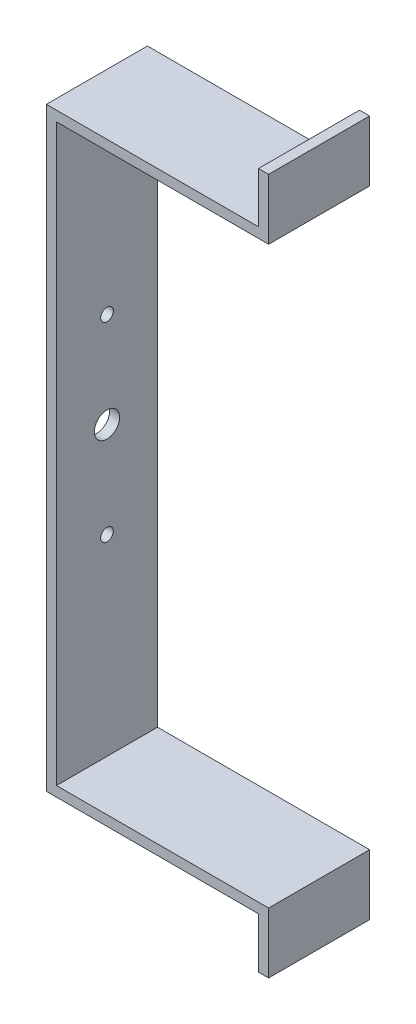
ISO-10303-21;
HEADER;
FILE_DESCRIPTION(('STEP AP214'),'2;1');
FILE_NAME('part.step','',(''),(''),'','','');
FILE_SCHEMA(('AUTOMOTIVE_DESIGN { 1 0 10303 214 1 1 1 1 }'));
ENDSEC;
DATA;
#1=APPLICATION_CONTEXT('core data for automotive mechanical design processes');
#2=APPLICATION_PROTOCOL_DEFINITION('international standard','automotive_design',2000,#1);
#3=PRODUCT_CONTEXT('',#1,'mechanical');
#4=PRODUCT('Part','Part','',(#3));
#5=PRODUCT_RELATED_PRODUCT_CATEGORY('part','',(#4));
#6=PRODUCT_DEFINITION_FORMATION('','',#4);
#7=PRODUCT_DEFINITION_CONTEXT('part definition',#1,'design');
#8=PRODUCT_DEFINITION('design','',#6,#7);
#9=PRODUCT_DEFINITION_SHAPE('','',#8);
#10=(LENGTH_UNIT() NAMED_UNIT(*) SI_UNIT(.MILLI.,.METRE.));
#11=(NAMED_UNIT(*) PLANE_ANGLE_UNIT() SI_UNIT($,.RADIAN.));
#12=(NAMED_UNIT(*) SI_UNIT($,.STERADIAN.) SOLID_ANGLE_UNIT());
#13=UNCERTAINTY_MEASURE_WITH_UNIT(LENGTH_MEASURE(1.E-05),#10,'distance_accuracy_value','');
#14=(GEOMETRIC_REPRESENTATION_CONTEXT(3) GLOBAL_UNCERTAINTY_ASSIGNED_CONTEXT((#13)) GLOBAL_UNIT_ASSIGNED_CONTEXT((#10,
#11,#12)) REPRESENTATION_CONTEXT('',''));
#15=CARTESIAN_POINT('',(0.,0.,0.));
#16=DIRECTION('',(0.,0.,1.));
#17=DIRECTION('',(1.,0.,0.));
#18=AXIS2_PLACEMENT_3D('',#15,#16,#17);
#19=CARTESIAN_POINT('',(53.34,-74.803,12.7));
#20=DIRECTION('',(1.,0.,0.));
#21=DIRECTION('',(0.,1.,0.));
#22=AXIS2_PLACEMENT_3D('',#19,#20,#21);
#23=PLANE('',#22);
#24=DIRECTION('',(0.,-1.,0.));
#25=VECTOR('',#24,1.);
#26=CARTESIAN_POINT('',(53.34,-74.803,-12.7));
#27=LINE('',#26,#25);
#28=CARTESIAN_POINT('',(53.34,-74.803,-12.7));
#29=VERTEX_POINT('',#28);
#30=CARTESIAN_POINT('',(53.34,-87.503,-12.7));
#31=VERTEX_POINT('',#30);
#32=EDGE_CURVE('E126',#29,#31,#27,.T.);
#33=ORIENTED_EDGE('',*,*,#32,.T.);
#34=DIRECTION('',(0.,0.,-1.));
#35=VECTOR('',#34,1.);
#36=CARTESIAN_POINT('',(53.34,-87.503,12.7));
#37=LINE('',#36,#35);
#38=CARTESIAN_POINT('',(53.34,-87.503,12.7));
#39=VERTEX_POINT('',#38);
#40=EDGE_CURVE('E11',#39,#31,#37,.T.);
#41=ORIENTED_EDGE('',*,*,#40,.F.);
#42=DIRECTION('',(0.,-1.,0.));
#43=VECTOR('',#42,1.);
#44=CARTESIAN_POINT('',(53.34,-74.803,12.7));
#45=LINE('',#44,#43);
#46=CARTESIAN_POINT('',(53.34,-74.803,12.7));
#47=VERTEX_POINT('',#46);
#48=EDGE_CURVE('E162',#47,#39,#45,.T.);
#49=ORIENTED_EDGE('',*,*,#48,.F.);
#50=DIRECTION('',(0.,0.,-1.));
#51=VECTOR('',#50,1.);
#52=CARTESIAN_POINT('',(53.34,-74.803,12.7));
#53=LINE('',#52,#51);
#54=EDGE_CURVE('E127',#47,#29,#53,.T.);
#55=ORIENTED_EDGE('',*,*,#54,.T.);
#56=EDGE_LOOP('',(#33,#41,#49,#55));
#57=FACE_BOUND('',#56,.T.);
#58=ADVANCED_FACE('F28',(#57),#23,.F.);
#59=CARTESIAN_POINT('',(55.88,-87.503,12.7));
#60=DIRECTION('',(0.,-1.,0.));
#61=DIRECTION('',(0.,0.,-1.));
#62=AXIS2_PLACEMENT_3D('',#59,#60,#61);
#63=PLANE('',#62);
#64=DIRECTION('',(-1.,0.,0.));
#65=VECTOR('',#64,1.);
#66=CARTESIAN_POINT('',(55.88,-87.503,-12.7));
#67=LINE('',#66,#65);
#68=CARTESIAN_POINT('',(55.88,-87.503,-12.7));
#69=VERTEX_POINT('',#68);
#70=EDGE_CURVE('E118',#69,#31,#67,.T.);
#71=ORIENTED_EDGE('',*,*,#70,.F.);
#72=DIRECTION('',(0.,0.,-1.));
#73=VECTOR('',#72,1.);
#74=CARTESIAN_POINT('',(55.88,-87.503,12.7));
#75=LINE('',#74,#73);
#76=CARTESIAN_POINT('',(55.88,-87.503,12.7));
#77=VERTEX_POINT('',#76);
#78=EDGE_CURVE('E35',#77,#69,#75,.T.);
#79=ORIENTED_EDGE('',*,*,#78,.F.);
#80=DIRECTION('',(-1.,0.,0.));
#81=VECTOR('',#80,1.);
#82=CARTESIAN_POINT('',(55.88,-87.503,12.7));
#83=LINE('',#82,#81);
#84=EDGE_CURVE('E121',#77,#39,#83,.T.);
#85=ORIENTED_EDGE('',*,*,#84,.T.);
#86=ORIENTED_EDGE('',*,*,#40,.T.);
#87=EDGE_LOOP('',(#71,#79,#85,#86));
#88=FACE_BOUND('',#87,.T.);
#89=ADVANCED_FACE('F116',(#88),#63,.T.);
#90=CARTESIAN_POINT('',(55.88,-74.803,12.7));
#91=DIRECTION('',(1.,0.,0.));
#92=DIRECTION('',(0.,1.,0.));
#93=AXIS2_PLACEMENT_3D('',#90,#91,#92);
#94=PLANE('',#93);
#95=DIRECTION('',(0.,-1.,0.));
#96=VECTOR('',#95,1.);
#97=CARTESIAN_POINT('',(55.88,-74.803,-12.7));
#98=LINE('',#97,#96);
#99=CARTESIAN_POINT('',(55.88,-72.263,-12.7));
#100=VERTEX_POINT('',#99);
#101=EDGE_CURVE('E135',#100,#69,#98,.T.);
#102=ORIENTED_EDGE('',*,*,#101,.F.);
#103=DIRECTION('',(0.,0.,-1.));
#104=VECTOR('',#103,1.);
#105=CARTESIAN_POINT('',(55.88,-72.263,12.7));
#106=LINE('',#105,#104);
#107=CARTESIAN_POINT('',(55.88,-72.263,12.7));
#108=VERTEX_POINT('',#107);
#109=EDGE_CURVE('E209',#108,#100,#106,.T.);
#110=ORIENTED_EDGE('',*,*,#109,.F.);
#111=DIRECTION('',(0.,-1.,0.));
#112=VECTOR('',#111,1.);
#113=CARTESIAN_POINT('',(55.88,-74.803,12.7));
#114=LINE('',#113,#112);
#115=EDGE_CURVE('E165',#108,#77,#114,.T.);
#116=ORIENTED_EDGE('',*,*,#115,.T.);
#117=ORIENTED_EDGE('',*,*,#78,.T.);
#118=EDGE_LOOP('',(#102,#110,#116,#117));
#119=FACE_BOUND('',#118,.T.);
#120=ADVANCED_FACE('F211',(#119),#94,.T.);
#121=CARTESIAN_POINT('',(0.,-72.263,12.7));
#122=DIRECTION('',(0.,1.,0.));
#123=DIRECTION('',(0.,0.,1.));
#124=AXIS2_PLACEMENT_3D('',#121,#122,#123);
#125=PLANE('',#124);
#126=DIRECTION('',(1.,0.,0.));
#127=VECTOR('',#126,1.);
#128=CARTESIAN_POINT('',(0.,-72.263,-12.7));
#129=LINE('',#128,#127);
#130=CARTESIAN_POINT('',(2.54000000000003,-72.263,-12.7));
#131=VERTEX_POINT('',#130);
#132=EDGE_CURVE('E137',#131,#100,#129,.T.);
#133=ORIENTED_EDGE('',*,*,#132,.F.);
#134=DIRECTION('',(0.,0.,-1.));
#135=VECTOR('',#134,1.);
#136=CARTESIAN_POINT('',(2.54000000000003,-72.263,12.7));
#137=LINE('',#136,#135);
#138=CARTESIAN_POINT('',(2.54000000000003,-72.263,12.7));
#139=VERTEX_POINT('',#138);
#140=EDGE_CURVE('E207',#139,#131,#137,.T.);
#141=ORIENTED_EDGE('',*,*,#140,.F.);
#142=DIRECTION('',(1.,0.,0.));
#143=VECTOR('',#142,1.);
#144=CARTESIAN_POINT('',(0.,-72.263,12.7));
#145=LINE('',#144,#143);
#146=EDGE_CURVE('E168',#139,#108,#145,.T.);
#147=ORIENTED_EDGE('',*,*,#146,.T.);
#148=ORIENTED_EDGE('',*,*,#109,.T.);
#149=EDGE_LOOP('',(#133,#141,#147,#148));
#150=FACE_BOUND('',#149,.T.);
#151=ADVANCED_FACE('F218',(#150),#125,.T.);
#152=CARTESIAN_POINT('',(2.54,74.803,12.7));
#153=DIRECTION('',(1.,0.,0.));
#154=DIRECTION('',(0.,1.,0.));
#155=AXIS2_PLACEMENT_3D('',#152,#153,#154);
#156=PLANE('',#155);
#157=CARTESIAN_POINT('',(2.54000000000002,-23.9776,0.));
#158=DIRECTION('',(1.,0.,0.));
#159=DIRECTION('',(0.,1.,0.));
#160=AXIS2_PLACEMENT_3D('',#157,#158,#159);
#161=CIRCLE('',#160,1.58749862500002);
#162=CARTESIAN_POINT('',(2.54000000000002,-25.565098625,0.));
#163=VERTEX_POINT('',#162);
#164=EDGE_CURVE('E372',#163,#163,#161,.T.);
#165=ORIENTED_EDGE('',*,*,#164,.F.);
#166=EDGE_LOOP('',(#165));
#167=FACE_BOUND('',#166,.T.);
#168=CARTESIAN_POINT('',(2.54000000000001,23.9776,0.));
#169=DIRECTION('',(1.,0.,0.));
#170=DIRECTION('',(0.,1.,0.));
#171=AXIS2_PLACEMENT_3D('',#168,#169,#170);
#172=CIRCLE('',#171,1.58749862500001);
#173=CARTESIAN_POINT('',(2.54000000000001,25.565098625,0.));
#174=VERTEX_POINT('',#173);
#175=EDGE_CURVE('E364',#174,#174,#172,.T.);
#176=ORIENTED_EDGE('',*,*,#175,.F.);
#177=EDGE_LOOP('',(#176));
#178=FACE_BOUND('',#177,.T.);
#179=CARTESIAN_POINT('',(2.54000000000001,0.,0.));
#180=DIRECTION('',(1.,0.,0.));
#181=DIRECTION('',(0.,1.,0.));
#182=AXIS2_PLACEMENT_3D('',#179,#180,#181);
#183=CIRCLE('',#182,3.175);
#184=CARTESIAN_POINT('',(2.54000000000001,3.175,0.));
#185=VERTEX_POINT('',#184);
#186=EDGE_CURVE('E362',#185,#185,#183,.T.);
#187=ORIENTED_EDGE('',*,*,#186,.F.);
#188=EDGE_LOOP('',(#187));
#189=FACE_BOUND('',#188,.T.);
#190=DIRECTION('',(0.,-1.,0.));
#191=VECTOR('',#190,1.);
#192=CARTESIAN_POINT('',(2.54,74.803,-12.7));
#193=LINE('',#192,#191);
#194=CARTESIAN_POINT('',(2.54,72.263,-12.7));
#195=VERTEX_POINT('',#194);
#196=EDGE_CURVE('E142',#195,#131,#193,.T.);
#197=ORIENTED_EDGE('',*,*,#196,.F.);
#198=DIRECTION('',(0.,0.,-1.));
#199=VECTOR('',#198,1.);
#200=CARTESIAN_POINT('',(2.54,72.263,12.7));
#201=LINE('',#200,#199);
#202=CARTESIAN_POINT('',(2.54,72.263,12.7));
#203=VERTEX_POINT('',#202);
#204=EDGE_CURVE('E205',#203,#195,#201,.T.);
#205=ORIENTED_EDGE('',*,*,#204,.F.);
#206=DIRECTION('',(0.,-1.,0.));
#207=VECTOR('',#206,1.);
#208=CARTESIAN_POINT('',(2.54,74.803,12.7));
#209=LINE('',#208,#207);
#210=EDGE_CURVE('E171',#203,#139,#209,.T.);
#211=ORIENTED_EDGE('',*,*,#210,.T.);
#212=ORIENTED_EDGE('',*,*,#140,.T.);
#213=EDGE_LOOP('',(#197,#205,#211,#212));
#214=FACE_BOUND('',#213,.T.);
#215=ADVANCED_FACE('F221',(#167,#178,#189,#214),#156,.T.);
#216=CARTESIAN_POINT('',(53.34,72.263,12.7));
#217=DIRECTION('',(0.,-1.,0.));
#218=DIRECTION('',(0.,0.,-1.));
#219=AXIS2_PLACEMENT_3D('',#216,#217,#218);
#220=PLANE('',#219);
#221=DIRECTION('',(1.,0.,0.));
#222=VECTOR('',#221,1.);
#223=CARTESIAN_POINT('',(53.34,72.263,-12.7));
#224=LINE('',#223,#222);
#225=CARTESIAN_POINT('',(55.88,72.263,-12.7));
#226=VERTEX_POINT('',#225);
#227=EDGE_CURVE('E145',#226,#195,#224,.F.);
#228=ORIENTED_EDGE('',*,*,#227,.F.);
#229=DIRECTION('',(0.,0.,-1.));
#230=VECTOR('',#229,1.);
#231=CARTESIAN_POINT('',(55.88,72.263,12.7));
#232=LINE('',#231,#230);
#233=CARTESIAN_POINT('',(55.88,72.263,12.7));
#234=VERTEX_POINT('',#233);
#235=EDGE_CURVE('E203',#234,#226,#232,.T.);
#236=ORIENTED_EDGE('',*,*,#235,.F.);
#237=DIRECTION('',(1.,0.,0.));
#238=VECTOR('',#237,1.);
#239=CARTESIAN_POINT('',(53.34,72.263,12.7));
#240=LINE('',#239,#238);
#241=EDGE_CURVE('E174',#234,#203,#240,.F.);
#242=ORIENTED_EDGE('',*,*,#241,.T.);
#243=ORIENTED_EDGE('',*,*,#204,.T.);
#244=EDGE_LOOP('',(#228,#236,#242,#243));
#245=FACE_BOUND('',#244,.T.);
#246=ADVANCED_FACE('F226',(#245),#220,.T.);
#247=CARTESIAN_POINT('',(55.88,74.803,12.7));
#248=DIRECTION('',(1.,0.,0.));
#249=DIRECTION('',(0.,0.,-1.));
#250=AXIS2_PLACEMENT_3D('',#247,#248,#249);
#251=PLANE('',#250);
#252=DIRECTION('',(0.,1.,0.));
#253=VECTOR('',#252,1.);
#254=CARTESIAN_POINT('',(55.88,74.803,-12.7));
#255=LINE('',#254,#253);
#256=CARTESIAN_POINT('',(55.88,87.503,-12.7));
#257=VERTEX_POINT('',#256);
#258=EDGE_CURVE('E148',#257,#226,#255,.F.);
#259=ORIENTED_EDGE('',*,*,#258,.F.);
#260=DIRECTION('',(0.,0.,-1.));
#261=VECTOR('',#260,1.);
#262=CARTESIAN_POINT('',(55.88,87.503,12.7));
#263=LINE('',#262,#261);
#264=CARTESIAN_POINT('',(55.88,87.503,12.7));
#265=VERTEX_POINT('',#264);
#266=EDGE_CURVE('E201',#265,#257,#263,.T.);
#267=ORIENTED_EDGE('',*,*,#266,.F.);
#268=DIRECTION('',(0.,1.,0.));
#269=VECTOR('',#268,1.);
#270=CARTESIAN_POINT('',(55.88,74.803,12.7));
#271=LINE('',#270,#269);
#272=EDGE_CURVE('E177',#265,#234,#271,.F.);
#273=ORIENTED_EDGE('',*,*,#272,.T.);
#274=ORIENTED_EDGE('',*,*,#235,.T.);
#275=EDGE_LOOP('',(#259,#267,#273,#274));
#276=FACE_BOUND('',#275,.T.);
#277=ADVANCED_FACE('F229',(#276),#251,.T.);
#278=CARTESIAN_POINT('',(53.34,87.503,12.7));
#279=DIRECTION('',(0.,1.,0.));
#280=DIRECTION('',(0.,0.,1.));
#281=AXIS2_PLACEMENT_3D('',#278,#279,#280);
#282=PLANE('',#281);
#283=DIRECTION('',(1.,0.,0.));
#284=VECTOR('',#283,1.);
#285=CARTESIAN_POINT('',(53.34,87.503,-12.7));
#286=LINE('',#285,#284);
#287=CARTESIAN_POINT('',(53.34,87.503,-12.7));
#288=VERTEX_POINT('',#287);
#289=EDGE_CURVE('E151',#288,#257,#286,.T.);
#290=ORIENTED_EDGE('',*,*,#289,.F.);
#291=DIRECTION('',(0.,0.,-1.));
#292=VECTOR('',#291,1.);
#293=CARTESIAN_POINT('',(53.34,87.503,12.7));
#294=LINE('',#293,#292);
#295=CARTESIAN_POINT('',(53.34,87.503,12.7));
#296=VERTEX_POINT('',#295);
#297=EDGE_CURVE('E199',#296,#288,#294,.T.);
#298=ORIENTED_EDGE('',*,*,#297,.F.);
#299=DIRECTION('',(1.,0.,0.));
#300=VECTOR('',#299,1.);
#301=CARTESIAN_POINT('',(53.34,87.503,12.7));
#302=LINE('',#301,#300);
#303=EDGE_CURVE('E180',#296,#265,#302,.T.);
#304=ORIENTED_EDGE('',*,*,#303,.T.);
#305=ORIENTED_EDGE('',*,*,#266,.T.);
#306=EDGE_LOOP('',(#290,#298,#304,#305));
#307=FACE_BOUND('',#306,.T.);
#308=ADVANCED_FACE('F233',(#307),#282,.T.);
#309=CARTESIAN_POINT('',(53.34,74.803,12.7));
#310=DIRECTION('',(1.,0.,0.));
#311=DIRECTION('',(0.,0.,-1.));
#312=AXIS2_PLACEMENT_3D('',#309,#310,#311);
#313=PLANE('',#312);
#314=DIRECTION('',(0.,-1.,0.));
#315=VECTOR('',#314,1.);
#316=CARTESIAN_POINT('',(53.34,74.803,-12.7));
#317=LINE('',#316,#315);
#318=CARTESIAN_POINT('',(53.34,74.803,-12.7));
#319=VERTEX_POINT('',#318);
#320=EDGE_CURVE('E154',#288,#319,#317,.T.);
#321=ORIENTED_EDGE('',*,*,#320,.T.);
#322=DIRECTION('',(0.,0.,-1.));
#323=VECTOR('',#322,1.);
#324=CARTESIAN_POINT('',(53.34,74.803,12.7));
#325=LINE('',#324,#323);
#326=CARTESIAN_POINT('',(53.34,74.803,12.7));
#327=VERTEX_POINT('',#326);
#328=EDGE_CURVE('E196',#327,#319,#325,.T.);
#329=ORIENTED_EDGE('',*,*,#328,.F.);
#330=DIRECTION('',(0.,-1.,0.));
#331=VECTOR('',#330,1.);
#332=CARTESIAN_POINT('',(53.34,74.803,12.7));
#333=LINE('',#332,#331);
#334=EDGE_CURVE('E183',#296,#327,#333,.T.);
#335=ORIENTED_EDGE('',*,*,#334,.F.);
#336=ORIENTED_EDGE('',*,*,#297,.T.);
#337=EDGE_LOOP('',(#321,#329,#335,#336));
#338=FACE_BOUND('',#337,.T.);
#339=ADVANCED_FACE('F238',(#338),#313,.F.);
#340=CARTESIAN_POINT('',(53.34,74.803,12.7));
#341=DIRECTION('',(0.,-1.,0.));
#342=DIRECTION('',(0.,0.,-1.));
#343=AXIS2_PLACEMENT_3D('',#340,#341,#342);
#344=PLANE('',#343);
#345=DIRECTION('',(-1.,0.,0.));
#346=VECTOR('',#345,1.);
#347=CARTESIAN_POINT('',(53.34,74.803,-12.7));
#348=LINE('',#347,#346);
#349=CARTESIAN_POINT('',(0.,74.803,-12.7));
#350=VERTEX_POINT('',#349);
#351=EDGE_CURVE('E156',#319,#350,#348,.T.);
#352=ORIENTED_EDGE('',*,*,#351,.T.);
#353=DIRECTION('',(0.,0.,-1.));
#354=VECTOR('',#353,1.);
#355=CARTESIAN_POINT('',(0.,74.803,12.7));
#356=LINE('',#355,#354);
#357=CARTESIAN_POINT('',(0.,74.803,12.7));
#358=VERTEX_POINT('',#357);
#359=EDGE_CURVE('E193',#358,#350,#356,.T.);
#360=ORIENTED_EDGE('',*,*,#359,.F.);
#361=DIRECTION('',(-1.,0.,0.));
#362=VECTOR('',#361,1.);
#363=CARTESIAN_POINT('',(53.34,74.803,12.7));
#364=LINE('',#363,#362);
#365=EDGE_CURVE('E185',#327,#358,#364,.T.);
#366=ORIENTED_EDGE('',*,*,#365,.F.);
#367=ORIENTED_EDGE('',*,*,#328,.T.);
#368=EDGE_LOOP('',(#352,#360,#366,#367));
#369=FACE_BOUND('',#368,.T.);
#370=ADVANCED_FACE('F242',(#369),#344,.F.);
#371=CARTESIAN_POINT('',(0.,74.803,12.7));
#372=DIRECTION('',(1.,0.,0.));
#373=DIRECTION('',(0.,1.,0.));
#374=AXIS2_PLACEMENT_3D('',#371,#372,#373);
#375=PLANE('',#374);
#376=CARTESIAN_POINT('',(0.,-23.9776,0.));
#377=DIRECTION('',(-1.,0.,0.));
#378=DIRECTION('',(0.,-1.,0.));
#379=AXIS2_PLACEMENT_3D('',#376,#377,#378);
#380=CIRCLE('',#379,1.58749862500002);
#381=CARTESIAN_POINT('',(0.,-25.565098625,0.));
#382=VERTEX_POINT('',#381);
#383=EDGE_CURVE('E375',#382,#382,#380,.T.);
#384=ORIENTED_EDGE('',*,*,#383,.F.);
#385=EDGE_LOOP('',(#384));
#386=FACE_BOUND('',#385,.T.);
#387=CARTESIAN_POINT('',(0.,23.9776,0.));
#388=DIRECTION('',(-1.,0.,0.));
#389=DIRECTION('',(0.,-1.,0.));
#390=AXIS2_PLACEMENT_3D('',#387,#388,#389);
#391=CIRCLE('',#390,1.58749862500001);
#392=CARTESIAN_POINT('',(0.,22.390101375,0.));
#393=VERTEX_POINT('',#392);
#394=EDGE_CURVE('E367',#393,#393,#391,.T.);
#395=ORIENTED_EDGE('',*,*,#394,.F.);
#396=EDGE_LOOP('',(#395));
#397=FACE_BOUND('',#396,.T.);
#398=CARTESIAN_POINT('',(0.,0.,0.));
#399=DIRECTION('',(1.,0.,0.));
#400=DIRECTION('',(0.,1.,0.));
#401=AXIS2_PLACEMENT_3D('',#398,#399,#400);
#402=CIRCLE('',#401,3.175);
#403=CARTESIAN_POINT('',(0.,3.175,0.));
#404=VERTEX_POINT('',#403);
#405=EDGE_CURVE('E130',#404,#404,#402,.T.);
#406=ORIENTED_EDGE('',*,*,#405,.T.);
#407=EDGE_LOOP('',(#406));
#408=FACE_BOUND('',#407,.T.);
#409=DIRECTION('',(0.,-1.,0.));
#410=VECTOR('',#409,1.);
#411=CARTESIAN_POINT('',(0.,74.803,-12.7));
#412=LINE('',#411,#410);
#413=CARTESIAN_POINT('',(0.,-74.803,-12.7));
#414=VERTEX_POINT('',#413);
#415=EDGE_CURVE('E158',#350,#414,#412,.T.);
#416=ORIENTED_EDGE('',*,*,#415,.T.);
#417=DIRECTION('',(0.,0.,-1.));
#418=VECTOR('',#417,1.);
#419=CARTESIAN_POINT('',(0.,-74.803,12.7));
#420=LINE('',#419,#418);
#421=CARTESIAN_POINT('',(0.,-74.803,12.7));
#422=VERTEX_POINT('',#421);
#423=EDGE_CURVE('E190',#422,#414,#420,.T.);
#424=ORIENTED_EDGE('',*,*,#423,.F.);
#425=DIRECTION('',(0.,-1.,0.));
#426=VECTOR('',#425,1.);
#427=CARTESIAN_POINT('',(0.,74.803,12.7));
#428=LINE('',#427,#426);
#429=EDGE_CURVE('E47',#358,#422,#428,.T.);
#430=ORIENTED_EDGE('',*,*,#429,.F.);
#431=ORIENTED_EDGE('',*,*,#359,.T.);
#432=EDGE_LOOP('',(#416,#424,#430,#431));
#433=FACE_BOUND('',#432,.T.);
#434=ADVANCED_FACE('F246',(#386,#397,#408,#433),#375,.F.);
#435=CARTESIAN_POINT('',(0.,-74.803,12.7));
#436=DIRECTION('',(0.,1.,0.));
#437=DIRECTION('',(0.,0.,1.));
#438=AXIS2_PLACEMENT_3D('',#435,#436,#437);
#439=PLANE('',#438);
#440=DIRECTION('',(1.,0.,0.));
#441=VECTOR('',#440,1.);
#442=CARTESIAN_POINT('',(0.,-74.803,-12.7));
#443=LINE('',#442,#441);
#444=EDGE_CURVE('E160',#414,#29,#443,.T.);
#445=ORIENTED_EDGE('',*,*,#444,.T.);
#446=ORIENTED_EDGE('',*,*,#54,.F.);
#447=DIRECTION('',(1.,0.,0.));
#448=VECTOR('',#447,1.);
#449=CARTESIAN_POINT('',(0.,-74.803,12.7));
#450=LINE('',#449,#448);
#451=EDGE_CURVE('E42',#422,#47,#450,.T.);
#452=ORIENTED_EDGE('',*,*,#451,.F.);
#453=ORIENTED_EDGE('',*,*,#423,.T.);
#454=EDGE_LOOP('',(#445,#446,#452,#453));
#455=FACE_BOUND('',#454,.T.);
#456=ADVANCED_FACE('F248',(#455),#439,.F.);
#457=CARTESIAN_POINT('',(53.34,-87.503,12.7));
#458=DIRECTION('',(0.,0.,-1.));
#459=DIRECTION('',(-1.,0.,0.));
#460=AXIS2_PLACEMENT_3D('',#457,#458,#459);
#461=PLANE('',#460);
#462=ORIENTED_EDGE('',*,*,#48,.T.);
#463=ORIENTED_EDGE('',*,*,#84,.F.);
#464=ORIENTED_EDGE('',*,*,#115,.F.);
#465=ORIENTED_EDGE('',*,*,#146,.F.);
#466=ORIENTED_EDGE('',*,*,#210,.F.);
#467=ORIENTED_EDGE('',*,*,#241,.F.);
#468=ORIENTED_EDGE('',*,*,#272,.F.);
#469=ORIENTED_EDGE('',*,*,#303,.F.);
#470=ORIENTED_EDGE('',*,*,#334,.T.);
#471=ORIENTED_EDGE('',*,*,#365,.T.);
#472=ORIENTED_EDGE('',*,*,#429,.T.);
#473=ORIENTED_EDGE('',*,*,#451,.T.);
#474=EDGE_LOOP('',(#462,#463,#464,#465,#466,#467,#468,#469,#470,#471,#472,#473));
#475=FACE_BOUND('',#474,.T.);
#476=ADVANCED_FACE('F213',(#475),#461,.F.);
#477=CARTESIAN_POINT('',(53.34,-87.503,-12.7));
#478=DIRECTION('',(0.,0.,-1.));
#479=DIRECTION('',(-1.,0.,0.));
#480=AXIS2_PLACEMENT_3D('',#477,#478,#479);
#481=PLANE('',#480);
#482=ORIENTED_EDGE('',*,*,#32,.F.);
#483=ORIENTED_EDGE('',*,*,#444,.F.);
#484=ORIENTED_EDGE('',*,*,#415,.F.);
#485=ORIENTED_EDGE('',*,*,#351,.F.);
#486=ORIENTED_EDGE('',*,*,#320,.F.);
#487=ORIENTED_EDGE('',*,*,#289,.T.);
#488=ORIENTED_EDGE('',*,*,#258,.T.);
#489=ORIENTED_EDGE('',*,*,#227,.T.);
#490=ORIENTED_EDGE('',*,*,#196,.T.);
#491=ORIENTED_EDGE('',*,*,#132,.T.);
#492=ORIENTED_EDGE('',*,*,#101,.T.);
#493=ORIENTED_EDGE('',*,*,#70,.T.);
#494=EDGE_LOOP('',(#482,#483,#484,#485,#486,#487,#488,#489,#490,#491,#492,#493));
#495=FACE_BOUND('',#494,.T.);
#496=ADVANCED_FACE('F132',(#495),#481,.T.);
#497=CARTESIAN_POINT('',(0.,0.,0.));
#498=DIRECTION('',(1.,0.,0.));
#499=DIRECTION('',(0.,1.,0.));
#500=AXIS2_PLACEMENT_3D('',#497,#498,#499);
#501=CYLINDRICAL_SURFACE('',#500,3.175);
#502=ORIENTED_EDGE('',*,*,#405,.F.);
#503=EDGE_LOOP('',(#502));
#504=FACE_BOUND('',#503,.T.);
#505=ORIENTED_EDGE('',*,*,#186,.T.);
#506=EDGE_LOOP('',(#505));
#507=FACE_BOUND('',#506,.T.);
#508=ADVANCED_FACE('F337',(#504,#507),#501,.F.);
#509=CARTESIAN_POINT('',(55.88,23.9776,0.));
#510=DIRECTION('',(-1.,0.,0.));
#511=DIRECTION('',(0.,-1.,0.));
#512=AXIS2_PLACEMENT_3D('',#509,#510,#511);
#513=CYLINDRICAL_SURFACE('',#512,1.58749862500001);
#514=ORIENTED_EDGE('',*,*,#175,.T.);
#515=EDGE_LOOP('',(#514));
#516=FACE_BOUND('',#515,.T.);
#517=ORIENTED_EDGE('',*,*,#394,.T.);
#518=EDGE_LOOP('',(#517));
#519=FACE_BOUND('',#518,.T.);
#520=ADVANCED_FACE('F319',(#516,#519),#513,.F.);
#521=CARTESIAN_POINT('',(55.8800000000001,-23.9776,0.));
#522=DIRECTION('',(-1.,0.,0.));
#523=DIRECTION('',(0.,-1.,0.));
#524=AXIS2_PLACEMENT_3D('',#521,#522,#523);
#525=CYLINDRICAL_SURFACE('',#524,1.58749862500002);
#526=CARTESIAN_POINT('',(2.54000000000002,-25.565098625,0.));
#527=CARTESIAN_POINT('',(2.51354166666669,-25.565098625,0.));
#528=CARTESIAN_POINT('',(2.48708333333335,-25.565098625,0.));
#529=CARTESIAN_POINT('',(2.43416666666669,-25.565098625,0.));
#530=CARTESIAN_POINT('',(2.40770833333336,-25.565098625,0.));
#531=CARTESIAN_POINT('',(2.35479166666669,-25.565098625,0.));
#532=CARTESIAN_POINT('',(2.32833333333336,-25.565098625,0.));
#533=CARTESIAN_POINT('',(2.27541666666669,-25.565098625,0.));
#534=CARTESIAN_POINT('',(2.24895833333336,-25.565098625,0.));
#535=CARTESIAN_POINT('',(2.19604166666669,-25.565098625,0.));
#536=CARTESIAN_POINT('',(2.16958333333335,-25.565098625,0.));
#537=CARTESIAN_POINT('',(2.11666666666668,-25.565098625,0.));
#538=CARTESIAN_POINT('',(2.09020833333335,-25.565098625,0.));
#539=CARTESIAN_POINT('',(2.03729166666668,-25.565098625,0.));
#540=CARTESIAN_POINT('',(2.01083333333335,-25.565098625,0.));
#541=CARTESIAN_POINT('',(1.95791666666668,-25.565098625,0.));
#542=CARTESIAN_POINT('',(1.93145833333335,-25.565098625,0.));
#543=CARTESIAN_POINT('',(1.87854166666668,-25.565098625,0.));
#544=CARTESIAN_POINT('',(1.85208333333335,-25.565098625,0.));
#545=CARTESIAN_POINT('',(1.79916666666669,-25.565098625,0.));
#546=CARTESIAN_POINT('',(1.77270833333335,-25.565098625,0.));
#547=CARTESIAN_POINT('',(1.71979166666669,-25.565098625,0.));
#548=CARTESIAN_POINT('',(1.69333333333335,-25.565098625,0.));
#549=CARTESIAN_POINT('',(1.64041666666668,-25.565098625,0.));
#550=CARTESIAN_POINT('',(1.61395833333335,-25.565098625,0.));
#551=CARTESIAN_POINT('',(1.56104166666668,-25.565098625,0.));
#552=CARTESIAN_POINT('',(1.53458333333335,-25.565098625,0.));
#553=CARTESIAN_POINT('',(1.48166666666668,-25.565098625,0.));
#554=CARTESIAN_POINT('',(1.45520833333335,-25.565098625,0.));
#555=CARTESIAN_POINT('',(1.40229166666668,-25.565098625,0.));
#556=CARTESIAN_POINT('',(1.37583333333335,-25.565098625,0.));
#557=CARTESIAN_POINT('',(1.32291666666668,-25.565098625,0.));
#558=CARTESIAN_POINT('',(1.29645833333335,-25.565098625,0.));
#559=CARTESIAN_POINT('',(1.24354166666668,-25.565098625,0.));
#560=CARTESIAN_POINT('',(1.21708333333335,-25.565098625,0.));
#561=CARTESIAN_POINT('',(1.16416666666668,-25.565098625,0.));
#562=CARTESIAN_POINT('',(1.13770833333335,-25.565098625,0.));
#563=CARTESIAN_POINT('',(1.08479166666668,-25.565098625,0.));
#564=CARTESIAN_POINT('',(1.05833333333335,-25.565098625,0.));
#565=CARTESIAN_POINT('',(1.00541666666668,-25.565098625,0.));
#566=CARTESIAN_POINT('',(0.978958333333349,-25.565098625,0.));
#567=CARTESIAN_POINT('',(0.92604166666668,-25.565098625,0.));
#568=CARTESIAN_POINT('',(0.899583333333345,-25.565098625,0.));
#569=CARTESIAN_POINT('',(0.846666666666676,-25.565098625,0.));
#570=CARTESIAN_POINT('',(0.820208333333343,-25.565098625,0.));
#571=CARTESIAN_POINT('',(0.767291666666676,-25.565098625,0.));
#572=CARTESIAN_POINT('',(0.740833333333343,-25.565098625,0.));
#573=CARTESIAN_POINT('',(0.687916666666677,-25.565098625,0.));
#574=CARTESIAN_POINT('',(0.661458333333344,-25.565098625,0.));
#575=CARTESIAN_POINT('',(0.608541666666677,-25.565098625,0.));
#576=CARTESIAN_POINT('',(0.582083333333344,-25.565098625,0.));
#577=CARTESIAN_POINT('',(0.529166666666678,-25.565098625,0.));
#578=CARTESIAN_POINT('',(0.502708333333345,-25.565098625,0.));
#579=CARTESIAN_POINT('',(0.449791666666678,-25.565098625,0.));
#580=CARTESIAN_POINT('',(0.423333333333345,-25.565098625,0.));
#581=CARTESIAN_POINT('',(0.370416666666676,-25.565098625,0.));
#582=CARTESIAN_POINT('',(0.343958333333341,-25.565098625,0.));
#583=CARTESIAN_POINT('',(0.291041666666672,-25.565098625,0.));
#584=CARTESIAN_POINT('',(0.264583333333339,-25.565098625,0.));
#585=CARTESIAN_POINT('',(0.211666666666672,-25.565098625,0.));
#586=CARTESIAN_POINT('',(0.185208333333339,-25.565098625,0.));
#587=CARTESIAN_POINT('',(0.132291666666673,-25.565098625,0.));
#588=CARTESIAN_POINT('',(0.10583333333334,-25.565098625,0.));
#589=CARTESIAN_POINT('',(0.0529166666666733,-25.565098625,0.));
#590=CARTESIAN_POINT('',(0.0264583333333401,-25.565098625,0.));
#591=CARTESIAN_POINT('',(0.,-25.565098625,0.));
#592=B_SPLINE_CURVE_WITH_KNOTS('',3,(#526,#527,#528,#529,#530,#531,#532,#533,#534,#535,#536,
#537,#538,#539,#540,#541,#542,#543,#544,#545,#546,#547,#548,#549,#550,#551,#552,#553,#554,#555,
#556,#557,#558,#559,#560,#561,#562,#563,#564,#565,#566,#567,#568,#569,#570,#571,#572,#573,#574,
#575,#576,#577,#578,#579,#580,#581,#582,#583,#584,#585,#586,#587,#588,#589,#590,#591),
.UNSPECIFIED.,.F.,.F.,(4,2,2,2,2,2,2,2,2,2,2,2,2,2,2,2,2,2,2,2,2,2,2,2,2,2,2,2,2,2,2,2,4),(0.,
0.0793749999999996,0.158749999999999,0.238124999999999,0.317499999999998,0.396875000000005,
0.476250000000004,0.555625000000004,0.635000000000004,0.714375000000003,0.793750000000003,
0.873125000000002,0.952500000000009,1.03187500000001,1.11125000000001,1.19062500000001,
1.27000000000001,1.34937500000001,1.42875000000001,1.50812500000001,1.58750000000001,
1.66687500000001,1.74625000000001,1.82562500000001,1.90500000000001,1.98437500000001,
2.06375000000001,2.14312500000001,2.22250000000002,2.30187500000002,2.38125000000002,
2.46062500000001,2.54000000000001),.UNSPECIFIED.);
#593=EDGE_CURVE('BSEAM327',#163,#382,#592,.T.);
#594=ORIENTED_EDGE('',*,*,#164,.T.);
#595=ORIENTED_EDGE('',*,*,#383,.T.);
#596=ORIENTED_EDGE('',*,*,#593,.T.);
#597=ORIENTED_EDGE('',*,*,#593,.F.);
#598=EDGE_LOOP('',(#594,#596,#595,#597));
#599=FACE_BOUND('',#598,.T.);
#600=ADVANCED_FACE('F327',(#599),#525,.F.);
#601=CLOSED_SHELL('',(#58,#89,#120,#151,#215,#246,#277,#308,#339,#370,#434,#456,#476,#496,#508,
#520,#600));
#602=MANIFOLD_SOLID_BREP('B2',#601);
#603=ADVANCED_BREP_SHAPE_REPRESENTATION('',(#18,#602),#14);
#604=SHAPE_DEFINITION_REPRESENTATION(#9,#603);
ENDSEC;
END-ISO-10303-21;
